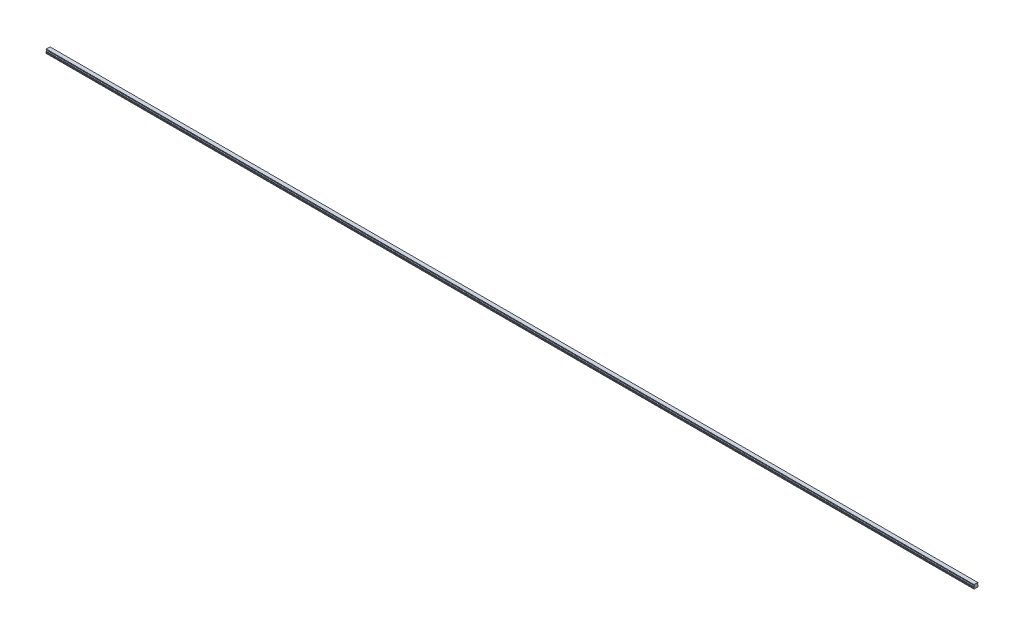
from build123d import *

# Parameters (mm, degrees)
BOSS_EXTRUDE1_DEPTH        = 3240
SKETCH3_R                  = 2.5
SKETCH3_R_2                = 2.1
CUT_EXTRUDE3_DEPTH         = 7
SKETCH3_2_R                = 2.1
CUT_EXTRUDE4_DEPTH         = 9.5
CHAMFER1_SIZE              = 0.4
LPATTERN2_COUNT            = 54
LPATTERN2_PITCH            = 60
CHAMFER1_OF_LPATTERN2_SIZE = 0.4


with BuildPart() as part:
    # Sketch1 → Boss-Extrude1 (new body)
    with BuildSketch(Plane(origin=(0, 0, 0), x_dir=(0, 0, -1), z_dir=(1, 0, 0))):
        with BuildLine():
            Line((6.59, 14), (-6.59, 14))
            Line((-6.59, 14), (-6.59, 13.15))
            Line((-6.59, 13.15), (-6.96, 12.356532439))
            Line((-6.96, 12.356532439), (-6.96, 11.435174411))
            ThreePointArc((-6.96, 11.435174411), (-5.25, 9.5), (-6.96, 7.564825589))
            Line((-6.96, 7.564825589), (-6.96, 6.643467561))
            Line((-6.96, 6.643467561), (-6.59, 5.85))
            Line((-6.59, 5.85), (-7.032116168, 4.2))
            Line((-7.032116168, 4.2), (-7.5, 3.929867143))
            Line((-7.5, 3.929867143), (-7.5, 1.4))
            Line((-7.5, 1.4), (-6.1, 0))
            Line((-6.1, 0), (-3.65, 0))
            Line((-3.65, 0), (-3.25, 0.4))
            Line((-3.25, 0.4), (3.25, 0.4))
            Line((3.25, 0.4), (3.65, 0))
            Line((3.65, 0), (6.1, 0))
            Line((6.1, 0), (7.5, 1.4))
            Line((7.5, 1.4), (7.5, 3.929867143))
            Line((7.5, 3.929867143), (7.032116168, 4.2))
            Line((7.032116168, 4.2), (6.59, 5.85))
            Line((6.59, 5.85), (6.96, 6.643467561))
            Line((6.96, 6.643467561), (6.96, 7.564825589))
            ThreePointArc((6.96, 7.564825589), (5.25, 9.5), (6.96, 11.435174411))
            Line((6.96, 11.435174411), (6.96, 12.356532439))
            Line((6.96, 12.356532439), (6.59, 13.15))
            Line((6.59, 13.15), (6.59, 14))
        make_face()
    extrude(amount=BOSS_EXTRUDE1_DEPTH)

    # Sketch3 → Cut-Extrude3 (cut)
    with BuildSketch(Plane.XZ):
        with Locations(Location((30, 0, 0), (0, 0, 270))):
            Circle(SKETCH3_R)
        with Locations(Location((30, 0, 0), (0, 0, 270))):
            Circle(SKETCH3_R_2, mode=Mode.SUBTRACT)
    cut_extrude3 = extrude(amount=-CUT_EXTRUDE3_DEPTH, mode=Mode.SUBTRACT)

    # Sketch3_2 → Cut-Extrude4 (cut)
    with BuildSketch(Plane.XZ):
        with Locations(Location((30, 0, 0), (0, 0, 270))):
            Circle(SKETCH3_2_R)
    cut_extrude4 = extrude(amount=-CUT_EXTRUDE4_DEPTH, mode=Mode.SUBTRACT)

    # Cut-Extrude5 cone 1 section (on through the dimple's axis) → Cut-Extrude5 (revolve, cut)
    with BuildSketch(Plane(origin=(30, 9.5, 0), x_dir=(0, 0, -1), z_dir=(1, 0, 0))):
        Polygon((0, 0), (2.1, 0), (0, 1.212435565), align=None)
    revolve(axis=Axis((30, 9.5, 0), (0, 1, 0)), mode=Mode.SUBTRACT)

    # Chamfer1
    chamfer1_edges = [part.edges().sort_by_distance(p)[0] for p in [
        (30, 0.4, 2.5),
    ]]
    chamfer(chamfer1_edges, length=CHAMFER1_SIZE)

    # LPattern2: Cut-Extrude3, Cut-Extrude4 ×54
    with Locations(*[(i * LPATTERN2_PITCH, 0, 0) for i in range(1, LPATTERN2_COUNT)]):
        add(cut_extrude3, mode=Mode.SUBTRACT)
        add(cut_extrude4, mode=Mode.SUBTRACT)

    # Chamfer1 of LPattern2
    chamfer1_of_lpattern2_edges = [part.edges().sort_by_distance(p)[0] for p in [
        (90, 0.4, 2.5),
        (150, 0.4, 2.5),
        (210, 0.4, 2.5),
        (270, 0.4, 2.5),
        (330, 0.4, 2.5),
        (390, 0.4, 2.5),
        (450, 0.4, 2.5),
        (510, 0.4, 2.5),
        (570, 0.4, 2.5),
        (630, 0.4, 2.5),
        (690, 0.4, 2.5),
        (750, 0.4, 2.5),
        (810, 0.4, 2.5),
        (870, 0.4, 2.5),
        (930, 0.4, 2.5),
        (990, 0.4, 2.5),
        (1050, 0.4, 2.5),
        (1110, 0.4, 2.5),
        (1170, 0.4, 2.5),
        (1230, 0.4, 2.5),
        (1290, 0.4, 2.5),
        (1350, 0.4, 2.5),
        (1410, 0.4, 2.5),
        (1470, 0.4, 2.5),
        (1530, 0.4, 2.5),
        (1590, 0.4, 2.5),
        (1650, 0.4, 2.5),
        (1710, 0.4, 2.5),
        (1770, 0.4, 2.5),
        (1830, 0.4, 2.5),
        (1890, 0.4, 2.5),
        (1950, 0.4, 2.5),
        (2010, 0.4, 2.5),
        (2070, 0.4, 2.5),
        (2130, 0.4, 2.5),
        (2190, 0.4, 2.5),
        (2250, 0.4, 2.5),
        (2310, 0.4, 2.5),
        (2370, 0.4, 2.5),
        (2430, 0.4, 2.5),
        (2490, 0.4, 2.5),
        (2550, 0.4, 2.5),
        (2610, 0.4, 2.5),
        (2670, 0.4, 2.5),
        (2730, 0.4, 2.5),
        (2790, 0.4, 2.5),
        (2850, 0.4, 2.5),
        (2910, 0.4, 2.5),
        (2970, 0.4, 2.5),
        (3030, 0.4, 2.5),
        (3090, 0.4, 2.5),
        (3150, 0.4, 2.5),
        (3210, 0.4, 2.5),
    ]]
    chamfer(chamfer1_of_lpattern2_edges, length=CHAMFER1_OF_LPATTERN2_SIZE)


solid = part.part
